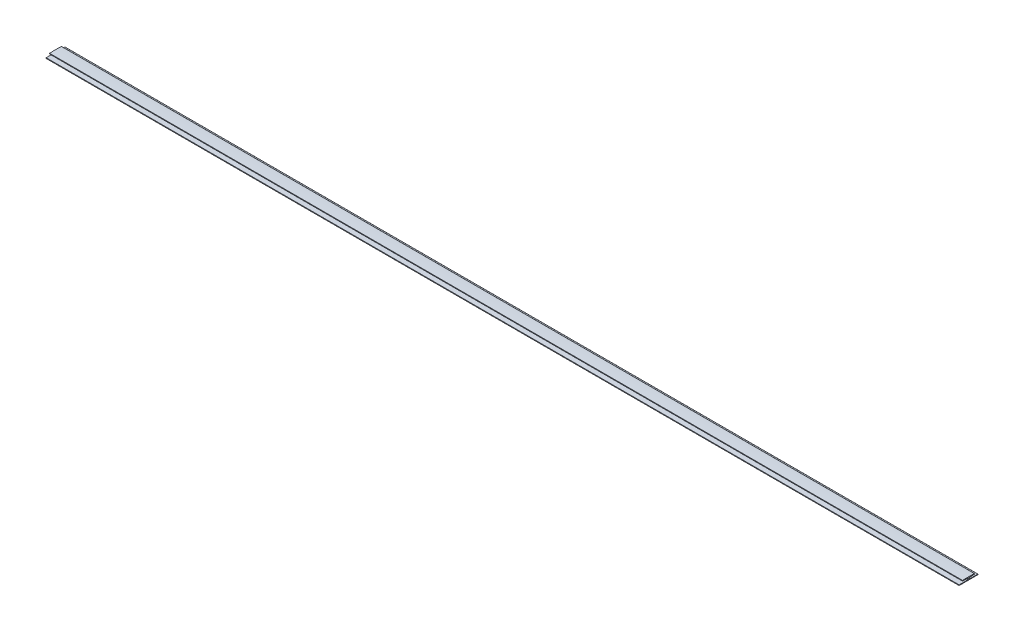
ISO-10303-21;
HEADER;
FILE_DESCRIPTION(('STEP AP214'),'2;1');
FILE_NAME('part.step','',(''),(''),'','','');
FILE_SCHEMA(('AUTOMOTIVE_DESIGN { 1 0 10303 214 1 1 1 1 }'));
ENDSEC;
DATA;
#1=APPLICATION_CONTEXT('core data for automotive mechanical design processes');
#2=APPLICATION_PROTOCOL_DEFINITION('international standard','automotive_design',2000,#1);
#3=PRODUCT_CONTEXT('',#1,'mechanical');
#4=PRODUCT('Part','Part','',(#3));
#5=PRODUCT_RELATED_PRODUCT_CATEGORY('part','',(#4));
#6=PRODUCT_DEFINITION_FORMATION('','',#4);
#7=PRODUCT_DEFINITION_CONTEXT('part definition',#1,'design');
#8=PRODUCT_DEFINITION('design','',#6,#7);
#9=PRODUCT_DEFINITION_SHAPE('','',#8);
#10=(LENGTH_UNIT() NAMED_UNIT(*) SI_UNIT(.MILLI.,.METRE.));
#11=(NAMED_UNIT(*) PLANE_ANGLE_UNIT() SI_UNIT($,.RADIAN.));
#12=(NAMED_UNIT(*) SI_UNIT($,.STERADIAN.) SOLID_ANGLE_UNIT());
#13=UNCERTAINTY_MEASURE_WITH_UNIT(LENGTH_MEASURE(1.E-05),#10,'distance_accuracy_value','');
#14=(GEOMETRIC_REPRESENTATION_CONTEXT(3) GLOBAL_UNCERTAINTY_ASSIGNED_CONTEXT((#13)) GLOBAL_UNIT_ASSIGNED_CONTEXT((#10,
#11,#12)) REPRESENTATION_CONTEXT('',''));
#15=CARTESIAN_POINT('',(0.,0.,0.));
#16=DIRECTION('',(0.,0.,1.));
#17=DIRECTION('',(1.,0.,0.));
#18=AXIS2_PLACEMENT_3D('',#15,#16,#17);
#19=CARTESIAN_POINT('',(-609.6,-0.230658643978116,12.446));
#20=DIRECTION('',(1.,0.,0.));
#21=DIRECTION('',(0.,0.,-1.));
#22=AXIS2_PLACEMENT_3D('',#19,#20,#21);
#23=CYLINDRICAL_SURFACE('',#22,0.254);
#24=DIRECTION('',(1.,0.,0.));
#25=VECTOR('',#24,1.);
#26=CARTESIAN_POINT('',(-609.6,-0.230658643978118,12.7));
#27=LINE('',#26,#25);
#28=CARTESIAN_POINT('',(-609.6,-0.230658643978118,12.7));
#29=VERTEX_POINT('',#28);
#30=CARTESIAN_POINT('',(609.6,-0.230658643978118,12.7));
#31=VERTEX_POINT('',#30);
#32=EDGE_CURVE('E37',#29,#31,#27,.T.);
#33=ORIENTED_EDGE('',*,*,#32,.T.);
#34=CARTESIAN_POINT('',(609.6,-0.230658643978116,12.446));
#35=DIRECTION('',(1.,0.,0.));
#36=DIRECTION('',(0.,0.,-1.));
#37=AXIS2_PLACEMENT_3D('',#34,#35,#36);
#38=CIRCLE('',#37,0.254);
#39=CARTESIAN_POINT('',(609.6,0.023341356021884,12.446));
#40=VERTEX_POINT('',#39);
#41=EDGE_CURVE('E170',#40,#31,#38,.T.);
#42=ORIENTED_EDGE('',*,*,#41,.F.);
#43=DIRECTION('',(1.,0.,0.));
#44=VECTOR('',#43,1.);
#45=CARTESIAN_POINT('',(-609.6,0.023341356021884,12.446));
#46=LINE('',#45,#44);
#47=CARTESIAN_POINT('',(-609.6,0.023341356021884,12.446));
#48=VERTEX_POINT('',#47);
#49=EDGE_CURVE('E11',#48,#40,#46,.T.);
#50=ORIENTED_EDGE('',*,*,#49,.F.);
#51=CARTESIAN_POINT('',(-609.6,-0.230658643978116,12.446));
#52=DIRECTION('',(1.,0.,0.));
#53=DIRECTION('',(0.,0.,-1.));
#54=AXIS2_PLACEMENT_3D('',#51,#52,#53);
#55=CIRCLE('',#54,0.254);
#56=EDGE_CURVE('E171',#48,#29,#55,.T.);
#57=ORIENTED_EDGE('',*,*,#56,.T.);
#58=EDGE_LOOP('',(#33,#42,#50,#57));
#59=FACE_BOUND('',#58,.T.);
#60=ADVANCED_FACE('F34',(#59),#23,.T.);
#61=CARTESIAN_POINT('',(-609.6,0.0233413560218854,0.396875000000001));
#62=DIRECTION('',(0.,1.,0.));
#63=DIRECTION('',(0.,0.,1.));
#64=AXIS2_PLACEMENT_3D('',#61,#62,#63);
#65=PLANE('',#64);
#66=ORIENTED_EDGE('',*,*,#49,.T.);
#67=DIRECTION('',(0.,0.,1.));
#68=VECTOR('',#67,1.);
#69=CARTESIAN_POINT('',(609.6,0.0233413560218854,0.396875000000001));
#70=LINE('',#69,#68);
#71=CARTESIAN_POINT('',(609.6,0.0233413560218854,0.396875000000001));
#72=VERTEX_POINT('',#71);
#73=EDGE_CURVE('E188',#72,#40,#70,.T.);
#74=ORIENTED_EDGE('',*,*,#73,.F.);
#75=DIRECTION('',(1.,0.,0.));
#76=VECTOR('',#75,1.);
#77=CARTESIAN_POINT('',(-609.6,0.0233413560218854,0.396875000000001));
#78=LINE('',#77,#76);
#79=CARTESIAN_POINT('',(-609.6,0.0233413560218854,0.396875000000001));
#80=VERTEX_POINT('',#79);
#81=EDGE_CURVE('E42',#80,#72,#78,.T.);
#82=ORIENTED_EDGE('',*,*,#81,.F.);
#83=DIRECTION('',(0.,0.,1.));
#84=VECTOR('',#83,1.);
#85=CARTESIAN_POINT('',(-609.6,0.0233413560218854,0.396875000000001));
#86=LINE('',#85,#84);
#87=EDGE_CURVE('E176',#80,#48,#86,.T.);
#88=ORIENTED_EDGE('',*,*,#87,.T.);
#89=EDGE_LOOP('',(#66,#74,#82,#88));
#90=FACE_BOUND('',#89,.T.);
#91=ADVANCED_FACE('F396',(#90),#65,.T.);
#92=CARTESIAN_POINT('',(-609.6,1.61084135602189,0.396875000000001));
#93=DIRECTION('',(0.,0.,1.));
#94=DIRECTION('',(0.,-1.,0.));
#95=AXIS2_PLACEMENT_3D('',#92,#93,#94);
#96=PLANE('',#95);
#97=ORIENTED_EDGE('',*,*,#81,.T.);
#98=DIRECTION('',(0.,-1.,0.));
#99=VECTOR('',#98,1.);
#100=CARTESIAN_POINT('',(609.6,1.61084135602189,0.396875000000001));
#101=LINE('',#100,#99);
#102=CARTESIAN_POINT('',(609.6,1.61084135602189,0.396875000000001));
#103=VERTEX_POINT('',#102);
#104=EDGE_CURVE('E237',#103,#72,#101,.T.);
#105=ORIENTED_EDGE('',*,*,#104,.F.);
#106=DIRECTION('',(1.,0.,0.));
#107=VECTOR('',#106,1.);
#108=CARTESIAN_POINT('',(-609.6,1.61084135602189,0.396875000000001));
#109=LINE('',#108,#107);
#110=CARTESIAN_POINT('',(-609.6,1.61084135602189,0.396875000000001));
#111=VERTEX_POINT('',#110);
#112=EDGE_CURVE('E295',#111,#103,#109,.T.);
#113=ORIENTED_EDGE('',*,*,#112,.F.);
#114=DIRECTION('',(0.,-1.,0.));
#115=VECTOR('',#114,1.);
#116=CARTESIAN_POINT('',(-609.6,1.61084135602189,0.396875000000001));
#117=LINE('',#116,#115);
#118=EDGE_CURVE('E291',#111,#80,#117,.T.);
#119=ORIENTED_EDGE('',*,*,#118,.T.);
#120=EDGE_LOOP('',(#97,#105,#113,#119));
#121=FACE_BOUND('',#120,.T.);
#122=ADVANCED_FACE('F395',(#121),#96,.T.);
#123=CARTESIAN_POINT('',(-609.6,2.08215074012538,7.90825231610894));
#124=DIRECTION('',(0.,-0.998037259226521,0.0626229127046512));
#125=DIRECTION('',(0.,-0.0626229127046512,-0.998037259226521));
#126=AXIS2_PLACEMENT_3D('',#123,#124,#125);
#127=PLANE('',#126);
#128=ORIENTED_EDGE('',*,*,#112,.T.);
#129=DIRECTION('',(0.,-0.0626229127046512,-0.998037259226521));
#130=VECTOR('',#129,1.);
#131=CARTESIAN_POINT('',(609.6,2.08215074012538,7.90825231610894));
#132=LINE('',#131,#130);
#133=CARTESIAN_POINT('',(609.6,2.08215074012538,7.90825231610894));
#134=VERTEX_POINT('',#133);
#135=EDGE_CURVE('E234',#134,#103,#132,.T.);
#136=ORIENTED_EDGE('',*,*,#135,.F.);
#137=DIRECTION('',(1.,0.,0.));
#138=VECTOR('',#137,1.);
#139=CARTESIAN_POINT('',(-609.6,2.08215074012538,7.90825231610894));
#140=LINE('',#139,#138);
#141=CARTESIAN_POINT('',(-609.6,2.08215074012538,7.90825231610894));
#142=VERTEX_POINT('',#141);
#143=EDGE_CURVE('E297',#142,#134,#140,.T.);
#144=ORIENTED_EDGE('',*,*,#143,.F.);
#145=DIRECTION('',(0.,-0.0626229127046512,-0.998037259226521));
#146=VECTOR('',#145,1.);
#147=CARTESIAN_POINT('',(-609.6,2.08215074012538,7.90825231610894));
#148=LINE('',#147,#146);
#149=EDGE_CURVE('E288',#142,#111,#148,.T.);
#150=ORIENTED_EDGE('',*,*,#149,.T.);
#151=EDGE_LOOP('',(#128,#136,#144,#150));
#152=FACE_BOUND('',#151,.T.);
#153=ADVANCED_FACE('F391',(#152),#127,.T.);
#154=CARTESIAN_POINT('',(-609.6,2.3356522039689,7.89234609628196));
#155=DIRECTION('',(1.,0.,0.));
#156=DIRECTION('',(0.,0.,-1.));
#157=AXIS2_PLACEMENT_3D('',#154,#155,#156);
#158=CYLINDRICAL_SURFACE('',#157,0.253999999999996);
#159=ORIENTED_EDGE('',*,*,#143,.T.);
#160=CARTESIAN_POINT('',(609.6,2.3356522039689,7.89234609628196));
#161=DIRECTION('',(1.,0.,0.));
#162=DIRECTION('',(0.,0.,-1.));
#163=AXIS2_PLACEMENT_3D('',#160,#161,#162);
#164=CIRCLE('',#163,0.253999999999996);
#165=CARTESIAN_POINT('',(609.6,2.35155842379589,8.14584756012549));
#166=VERTEX_POINT('',#165);
#167=EDGE_CURVE('E231',#166,#134,#164,.T.);
#168=ORIENTED_EDGE('',*,*,#167,.F.);
#169=DIRECTION('',(1.,0.,0.));
#170=VECTOR('',#169,1.);
#171=CARTESIAN_POINT('',(-609.6,2.35155842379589,8.14584756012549));
#172=LINE('',#171,#170);
#173=CARTESIAN_POINT('',(-609.6,2.35155842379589,8.14584756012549));
#174=VERTEX_POINT('',#173);
#175=EDGE_CURVE('E299',#174,#166,#172,.T.);
#176=ORIENTED_EDGE('',*,*,#175,.F.);
#177=CARTESIAN_POINT('',(-609.6,2.3356522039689,7.89234609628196));
#178=DIRECTION('',(1.,0.,0.));
#179=DIRECTION('',(0.,0.,-1.));
#180=AXIS2_PLACEMENT_3D('',#177,#178,#179);
#181=CIRCLE('',#180,0.253999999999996);
#182=EDGE_CURVE('E285',#174,#142,#181,.T.);
#183=ORIENTED_EDGE('',*,*,#182,.T.);
#184=EDGE_LOOP('',(#159,#168,#176,#183));
#185=FACE_BOUND('',#184,.T.);
#186=ADVANCED_FACE('F386',(#185),#158,.T.);
#187=CARTESIAN_POINT('',(-609.6,2.63674757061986,8.12795306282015));
#188=DIRECTION('',(0.,0.0626229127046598,0.99803725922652));
#189=DIRECTION('',(0.,-0.99803725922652,0.0626229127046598));
#190=AXIS2_PLACEMENT_3D('',#187,#188,#189);
#191=PLANE('',#190);
#192=ORIENTED_EDGE('',*,*,#175,.T.);
#193=DIRECTION('',(0.,-0.99803725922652,0.0626229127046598));
#194=VECTOR('',#193,1.);
#195=CARTESIAN_POINT('',(609.6,2.63674757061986,8.12795306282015));
#196=LINE('',#195,#194);
#197=CARTESIAN_POINT('',(609.6,2.63674757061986,8.12795306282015));
#198=VERTEX_POINT('',#197);
#199=EDGE_CURVE('E228',#198,#166,#196,.T.);
#200=ORIENTED_EDGE('',*,*,#199,.F.);
#201=DIRECTION('',(1.,0.,0.));
#202=VECTOR('',#201,1.);
#203=CARTESIAN_POINT('',(-609.6,2.63674757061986,8.12795306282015));
#204=LINE('',#203,#202);
#205=CARTESIAN_POINT('',(-609.6,2.63674757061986,8.12795306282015));
#206=VERTEX_POINT('',#205);
#207=EDGE_CURVE('E301',#206,#198,#204,.T.);
#208=ORIENTED_EDGE('',*,*,#207,.F.);
#209=DIRECTION('',(0.,-0.99803725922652,0.0626229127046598));
#210=VECTOR('',#209,1.);
#211=CARTESIAN_POINT('',(-609.6,2.63674757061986,8.12795306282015));
#212=LINE('',#211,#210);
#213=EDGE_CURVE('E282',#206,#174,#212,.T.);
#214=ORIENTED_EDGE('',*,*,#213,.T.);
#215=EDGE_LOOP('',(#192,#200,#208,#214));
#216=FACE_BOUND('',#215,.T.);
#217=ADVANCED_FACE('F384',(#216),#191,.T.);
#218=CARTESIAN_POINT('',(-609.6,2.62084135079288,7.87445159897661));
#219=DIRECTION('',(1.,0.,0.));
#220=DIRECTION('',(0.,0.,-1.));
#221=AXIS2_PLACEMENT_3D('',#218,#219,#220);
#222=CYLINDRICAL_SURFACE('',#221,0.254000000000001);
#223=ORIENTED_EDGE('',*,*,#207,.T.);
#224=CARTESIAN_POINT('',(609.6,2.62084135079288,7.87445159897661));
#225=DIRECTION('',(1.,0.,0.));
#226=DIRECTION('',(0.,0.,-1.));
#227=AXIS2_PLACEMENT_3D('',#224,#225,#226);
#228=CIRCLE('',#227,0.254000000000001);
#229=CARTESIAN_POINT('',(609.6,2.87434281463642,7.85854537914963));
#230=VERTEX_POINT('',#229);
#231=EDGE_CURVE('E225',#230,#198,#228,.T.);
#232=ORIENTED_EDGE('',*,*,#231,.F.);
#233=DIRECTION('',(1.,0.,0.));
#234=VECTOR('',#233,1.);
#235=CARTESIAN_POINT('',(-609.6,2.87434281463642,7.85854537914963));
#236=LINE('',#235,#234);
#237=CARTESIAN_POINT('',(-609.6,2.87434281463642,7.85854537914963));
#238=VERTEX_POINT('',#237);
#239=EDGE_CURVE('E303',#238,#230,#236,.T.);
#240=ORIENTED_EDGE('',*,*,#239,.F.);
#241=CARTESIAN_POINT('',(-609.6,2.62084135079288,7.87445159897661));
#242=DIRECTION('',(1.,0.,0.));
#243=DIRECTION('',(0.,0.,-1.));
#244=AXIS2_PLACEMENT_3D('',#241,#242,#243);
#245=CIRCLE('',#244,0.254000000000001);
#246=EDGE_CURVE('E279',#238,#206,#245,.T.);
#247=ORIENTED_EDGE('',*,*,#246,.T.);
#248=EDGE_LOOP('',(#223,#232,#240,#247));
#249=FACE_BOUND('',#248,.T.);
#250=ADVANCED_FACE('F379',(#249),#222,.T.);
#251=CARTESIAN_POINT('',(-609.6,-149.322908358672,1.1910830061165E-08));
#252=DIRECTION('',(1.,0.,0.));
#253=DIRECTION('',(0.,0.,-1.));
#254=AXIS2_PLACEMENT_3D('',#251,#252,#253);
#255=CYLINDRICAL_SURFACE('',#254,152.4);
#256=ORIENTED_EDGE('',*,*,#239,.T.);
#257=CARTESIAN_POINT('',(609.6,-149.322908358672,1.1910830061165E-08));
#258=DIRECTION('',(1.,0.,0.));
#259=DIRECTION('',(0.,0.,1.));
#260=AXIS2_PLACEMENT_3D('',#257,#258,#259);
#261=CIRCLE('',#260,152.4);
#262=CARTESIAN_POINT('',(609.6,2.87434281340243,-7.85854537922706));
#263=VERTEX_POINT('',#262);
#264=EDGE_CURVE('E222',#263,#230,#261,.T.);
#265=ORIENTED_EDGE('',*,*,#264,.F.);
#266=DIRECTION('',(1.,0.,0.));
#267=VECTOR('',#266,1.);
#268=CARTESIAN_POINT('',(-609.6,2.87434281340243,-7.85854537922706));
#269=LINE('',#268,#267);
#270=CARTESIAN_POINT('',(-609.6,2.87434281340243,-7.85854537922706));
#271=VERTEX_POINT('',#270);
#272=EDGE_CURVE('E305',#271,#263,#269,.T.);
#273=ORIENTED_EDGE('',*,*,#272,.F.);
#274=CARTESIAN_POINT('',(-609.6,-149.322908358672,1.1910830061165E-08));
#275=DIRECTION('',(1.,0.,0.));
#276=DIRECTION('',(0.,0.,1.));
#277=AXIS2_PLACEMENT_3D('',#274,#275,#276);
#278=CIRCLE('',#277,152.4);
#279=EDGE_CURVE('E276',#271,#238,#278,.T.);
#280=ORIENTED_EDGE('',*,*,#279,.T.);
#281=EDGE_LOOP('',(#256,#265,#273,#280));
#282=FACE_BOUND('',#281,.T.);
#283=ADVANCED_FACE('F374',(#282),#255,.T.);
#284=CARTESIAN_POINT('',(-609.6,2.62084134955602,-7.87445159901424));
#285=DIRECTION('',(1.,0.,0.));
#286=DIRECTION('',(0.,0.,-1.));
#287=AXIS2_PLACEMENT_3D('',#284,#285,#286);
#288=CYLINDRICAL_SURFACE('',#287,0.254000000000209);
#289=ORIENTED_EDGE('',*,*,#272,.T.);
#290=CARTESIAN_POINT('',(609.6,2.62084134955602,-7.87445159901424));
#291=DIRECTION('',(1.,0.,0.));
#292=DIRECTION('',(0.,0.,1.));
#293=AXIS2_PLACEMENT_3D('',#290,#291,#292);
#294=CIRCLE('',#293,0.254000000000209);
#295=CARTESIAN_POINT('',(609.6,2.63674756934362,-8.12795306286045));
#296=VERTEX_POINT('',#295);
#297=EDGE_CURVE('E219',#296,#263,#294,.T.);
#298=ORIENTED_EDGE('',*,*,#297,.F.);
#299=DIRECTION('',(1.,0.,0.));
#300=VECTOR('',#299,1.);
#301=CARTESIAN_POINT('',(-609.6,2.63674756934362,-8.12795306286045));
#302=LINE('',#301,#300);
#303=CARTESIAN_POINT('',(-609.6,2.63674756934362,-8.12795306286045));
#304=VERTEX_POINT('',#303);
#305=EDGE_CURVE('E307',#304,#296,#302,.T.);
#306=ORIENTED_EDGE('',*,*,#305,.F.);
#307=CARTESIAN_POINT('',(-609.6,2.62084134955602,-7.87445159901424));
#308=DIRECTION('',(1.,0.,0.));
#309=DIRECTION('',(0.,0.,1.));
#310=AXIS2_PLACEMENT_3D('',#307,#308,#309);
#311=CIRCLE('',#310,0.254000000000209);
#312=EDGE_CURVE('E273',#304,#271,#311,.T.);
#313=ORIENTED_EDGE('',*,*,#312,.T.);
#314=EDGE_LOOP('',(#289,#298,#306,#313));
#315=FACE_BOUND('',#314,.T.);
#316=ADVANCED_FACE('F372',(#315),#288,.T.);
#317=CARTESIAN_POINT('',(-609.6,2.63674756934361,-8.12795306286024));
#318=DIRECTION('',(0.,0.0626229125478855,-0.998037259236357));
#319=DIRECTION('',(0.,0.998037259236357,0.0626229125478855));
#320=AXIS2_PLACEMENT_3D('',#317,#318,#319);
#321=PLANE('',#320);
#322=ORIENTED_EDGE('',*,*,#305,.T.);
#323=DIRECTION('',(0.,0.998037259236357,0.0626229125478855));
#324=VECTOR('',#323,1.);
#325=CARTESIAN_POINT('',(609.6,2.63674756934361,-8.12795306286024));
#326=LINE('',#325,#324);
#327=CARTESIAN_POINT('',(609.6,2.3515584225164,-8.14584756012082));
#328=VERTEX_POINT('',#327);
#329=EDGE_CURVE('E216',#328,#296,#326,.T.);
#330=ORIENTED_EDGE('',*,*,#329,.F.);
#331=DIRECTION('',(1.,0.,0.));
#332=VECTOR('',#331,1.);
#333=CARTESIAN_POINT('',(-609.6,2.3515584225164,-8.14584756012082));
#334=LINE('',#333,#332);
#335=CARTESIAN_POINT('',(-609.6,2.3515584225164,-8.14584756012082));
#336=VERTEX_POINT('',#335);
#337=EDGE_CURVE('E309',#336,#328,#334,.T.);
#338=ORIENTED_EDGE('',*,*,#337,.F.);
#339=DIRECTION('',(0.,0.998037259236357,0.0626229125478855));
#340=VECTOR('',#339,1.);
#341=CARTESIAN_POINT('',(-609.6,2.63674756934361,-8.12795306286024));
#342=LINE('',#341,#340);
#343=EDGE_CURVE('E270',#336,#304,#342,.T.);
#344=ORIENTED_EDGE('',*,*,#343,.T.);
#345=EDGE_LOOP('',(#322,#330,#338,#344));
#346=FACE_BOUND('',#345,.T.);
#347=ADVANCED_FACE('F367',(#346),#321,.T.);
#348=CARTESIAN_POINT('',(-609.6,2.33565220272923,-7.8923460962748));
#349=DIRECTION('',(1.,0.,0.));
#350=DIRECTION('',(0.,0.,-1.));
#351=AXIS2_PLACEMENT_3D('',#348,#349,#350);
#352=CYLINDRICAL_SURFACE('',#351,0.253999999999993);
#353=ORIENTED_EDGE('',*,*,#337,.T.);
#354=CARTESIAN_POINT('',(609.6,2.33565220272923,-7.8923460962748));
#355=DIRECTION('',(1.,0.,0.));
#356=DIRECTION('',(0.,0.,1.));
#357=AXIS2_PLACEMENT_3D('',#354,#355,#356);
#358=CIRCLE('',#357,0.253999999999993);
#359=CARTESIAN_POINT('',(609.6,2.08215073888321,-7.90825231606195));
#360=VERTEX_POINT('',#359);
#361=EDGE_CURVE('E213',#360,#328,#358,.T.);
#362=ORIENTED_EDGE('',*,*,#361,.F.);
#363=DIRECTION('',(1.,0.,0.));
#364=VECTOR('',#363,1.);
#365=CARTESIAN_POINT('',(-609.6,2.08215073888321,-7.90825231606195));
#366=LINE('',#365,#364);
#367=CARTESIAN_POINT('',(-609.6,2.08215073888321,-7.90825231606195));
#368=VERTEX_POINT('',#367);
#369=EDGE_CURVE('E311',#368,#360,#366,.T.);
#370=ORIENTED_EDGE('',*,*,#369,.F.);
#371=CARTESIAN_POINT('',(-609.6,2.33565220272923,-7.8923460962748));
#372=DIRECTION('',(1.,0.,0.));
#373=DIRECTION('',(0.,0.,1.));
#374=AXIS2_PLACEMENT_3D('',#371,#372,#373);
#375=CIRCLE('',#374,0.253999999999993);
#376=EDGE_CURVE('E267',#368,#336,#375,.T.);
#377=ORIENTED_EDGE('',*,*,#376,.T.);
#378=EDGE_LOOP('',(#353,#362,#370,#377));
#379=FACE_BOUND('',#378,.T.);
#380=ADVANCED_FACE('F362',(#379),#352,.T.);
#381=CARTESIAN_POINT('',(-609.6,2.08215073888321,-7.90825231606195));
#382=DIRECTION('',(0.,-0.998037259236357,-0.0626229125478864));
#383=DIRECTION('',(0.,0.0626229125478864,-0.998037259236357));
#384=AXIS2_PLACEMENT_3D('',#381,#382,#383);
#385=PLANE('',#384);
#386=ORIENTED_EDGE('',*,*,#369,.T.);
#387=DIRECTION('',(0.,0.0626229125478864,-0.998037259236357));
#388=VECTOR('',#387,1.);
#389=CARTESIAN_POINT('',(609.6,2.08215073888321,-7.90825231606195));
#390=LINE('',#389,#388);
#391=CARTESIAN_POINT('',(609.6,1.61084135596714,-0.396874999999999));
#392=VERTEX_POINT('',#391);
#393=EDGE_CURVE('E210',#392,#360,#390,.T.);
#394=ORIENTED_EDGE('',*,*,#393,.F.);
#395=DIRECTION('',(1.,0.,0.));
#396=VECTOR('',#395,1.);
#397=CARTESIAN_POINT('',(-609.6,1.61084135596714,-0.396874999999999));
#398=LINE('',#397,#396);
#399=CARTESIAN_POINT('',(-609.6,1.61084135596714,-0.396874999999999));
#400=VERTEX_POINT('',#399);
#401=EDGE_CURVE('E313',#400,#392,#398,.T.);
#402=ORIENTED_EDGE('',*,*,#401,.F.);
#403=DIRECTION('',(0.,0.0626229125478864,-0.998037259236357));
#404=VECTOR('',#403,1.);
#405=CARTESIAN_POINT('',(-609.6,2.08215073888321,-7.90825231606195));
#406=LINE('',#405,#404);
#407=EDGE_CURVE('E264',#400,#368,#406,.T.);
#408=ORIENTED_EDGE('',*,*,#407,.T.);
#409=EDGE_LOOP('',(#386,#394,#402,#408));
#410=FACE_BOUND('',#409,.T.);
#411=ADVANCED_FACE('F360',(#410),#385,.T.);
#412=CARTESIAN_POINT('',(-609.6,1.61084135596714,-0.396874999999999));
#413=DIRECTION('',(0.,0.,-1.));
#414=DIRECTION('',(-1.,0.,0.));
#415=AXIS2_PLACEMENT_3D('',#412,#413,#414);
#416=PLANE('',#415);
#417=ORIENTED_EDGE('',*,*,#401,.T.);
#418=DIRECTION('',(0.,1.,0.));
#419=VECTOR('',#418,1.);
#420=CARTESIAN_POINT('',(609.6,1.61084135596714,-0.396874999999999));
#421=LINE('',#420,#419);
#422=CARTESIAN_POINT('',(609.6,0.,-0.396874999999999));
#423=VERTEX_POINT('',#422);
#424=EDGE_CURVE('E207',#423,#392,#421,.T.);
#425=ORIENTED_EDGE('',*,*,#424,.F.);
#426=DIRECTION('',(1.,0.,0.));
#427=VECTOR('',#426,1.);
#428=CARTESIAN_POINT('',(-609.6,0.,-0.396874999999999));
#429=LINE('',#428,#427);
#430=CARTESIAN_POINT('',(-609.6,0.,-0.396874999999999));
#431=VERTEX_POINT('',#430);
#432=EDGE_CURVE('E315',#431,#423,#429,.T.);
#433=ORIENTED_EDGE('',*,*,#432,.F.);
#434=DIRECTION('',(0.,1.,0.));
#435=VECTOR('',#434,1.);
#436=CARTESIAN_POINT('',(-609.6,1.61084135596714,-0.396874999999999));
#437=LINE('',#436,#435);
#438=EDGE_CURVE('E261',#431,#400,#437,.T.);
#439=ORIENTED_EDGE('',*,*,#438,.T.);
#440=EDGE_LOOP('',(#417,#425,#433,#439));
#441=FACE_BOUND('',#440,.T.);
#442=ADVANCED_FACE('F355',(#441),#416,.T.);
#443=CARTESIAN_POINT('',(-609.6,0.,-12.446));
#444=DIRECTION('',(0.,1.,0.));
#445=DIRECTION('',(0.,0.,1.));
#446=AXIS2_PLACEMENT_3D('',#443,#444,#445);
#447=PLANE('',#446);
#448=ORIENTED_EDGE('',*,*,#432,.T.);
#449=DIRECTION('',(0.,0.,1.));
#450=VECTOR('',#449,1.);
#451=CARTESIAN_POINT('',(609.6,0.,-12.446));
#452=LINE('',#451,#450);
#453=CARTESIAN_POINT('',(609.6,0.,-12.446));
#454=VERTEX_POINT('',#453);
#455=EDGE_CURVE('E204',#454,#423,#452,.T.);
#456=ORIENTED_EDGE('',*,*,#455,.F.);
#457=DIRECTION('',(1.,0.,0.));
#458=VECTOR('',#457,1.);
#459=CARTESIAN_POINT('',(-609.6,0.,-12.446));
#460=LINE('',#459,#458);
#461=CARTESIAN_POINT('',(-609.6,0.,-12.446));
#462=VERTEX_POINT('',#461);
#463=EDGE_CURVE('E317',#462,#454,#460,.T.);
#464=ORIENTED_EDGE('',*,*,#463,.F.);
#465=DIRECTION('',(0.,0.,1.));
#466=VECTOR('',#465,1.);
#467=CARTESIAN_POINT('',(-609.6,0.,-12.446));
#468=LINE('',#467,#466);
#469=EDGE_CURVE('E258',#462,#431,#468,.T.);
#470=ORIENTED_EDGE('',*,*,#469,.T.);
#471=EDGE_LOOP('',(#448,#456,#464,#470));
#472=FACE_BOUND('',#471,.T.);
#473=ADVANCED_FACE('F350',(#472),#447,.T.);
#474=CARTESIAN_POINT('',(-609.6,-0.254,-12.446));
#475=DIRECTION('',(1.,0.,0.));
#476=DIRECTION('',(0.,0.,-1.));
#477=AXIS2_PLACEMENT_3D('',#474,#475,#476);
#478=CYLINDRICAL_SURFACE('',#477,0.254);
#479=ORIENTED_EDGE('',*,*,#463,.T.);
#480=CARTESIAN_POINT('',(609.6,-0.254,-12.446));
#481=DIRECTION('',(1.,0.,0.));
#482=DIRECTION('',(0.,0.,-1.));
#483=AXIS2_PLACEMENT_3D('',#480,#481,#482);
#484=CIRCLE('',#483,0.254);
#485=CARTESIAN_POINT('',(609.6,-0.254000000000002,-12.7));
#486=VERTEX_POINT('',#485);
#487=EDGE_CURVE('E201',#486,#454,#484,.T.);
#488=ORIENTED_EDGE('',*,*,#487,.F.);
#489=DIRECTION('',(1.,0.,0.));
#490=VECTOR('',#489,1.);
#491=CARTESIAN_POINT('',(-609.6,-0.254000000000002,-12.7));
#492=LINE('',#491,#490);
#493=CARTESIAN_POINT('',(-609.6,-0.254000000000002,-12.7));
#494=VERTEX_POINT('',#493);
#495=EDGE_CURVE('E319',#494,#486,#492,.T.);
#496=ORIENTED_EDGE('',*,*,#495,.F.);
#497=CARTESIAN_POINT('',(-609.6,-0.254,-12.446));
#498=DIRECTION('',(1.,0.,0.));
#499=DIRECTION('',(0.,0.,-1.));
#500=AXIS2_PLACEMENT_3D('',#497,#498,#499);
#501=CIRCLE('',#500,0.254);
#502=EDGE_CURVE('E255',#494,#462,#501,.T.);
#503=ORIENTED_EDGE('',*,*,#502,.T.);
#504=EDGE_LOOP('',(#479,#488,#496,#503));
#505=FACE_BOUND('',#504,.T.);
#506=ADVANCED_FACE('F348',(#505),#478,.T.);
#507=CARTESIAN_POINT('',(-609.6,-0.539749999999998,-12.7));
#508=DIRECTION('',(0.,0.,-1.));
#509=DIRECTION('',(-1.,0.,0.));
#510=AXIS2_PLACEMENT_3D('',#507,#508,#509);
#511=PLANE('',#510);
#512=ORIENTED_EDGE('',*,*,#495,.T.);
#513=DIRECTION('',(0.,1.,0.));
#514=VECTOR('',#513,1.);
#515=CARTESIAN_POINT('',(609.6,-0.539749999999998,-12.7));
#516=LINE('',#515,#514);
#517=CARTESIAN_POINT('',(609.6,-0.539749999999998,-12.7));
#518=VERTEX_POINT('',#517);
#519=EDGE_CURVE('E198',#518,#486,#516,.T.);
#520=ORIENTED_EDGE('',*,*,#519,.F.);
#521=DIRECTION('',(1.,0.,0.));
#522=VECTOR('',#521,1.);
#523=CARTESIAN_POINT('',(-609.6,-0.539749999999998,-12.7));
#524=LINE('',#523,#522);
#525=CARTESIAN_POINT('',(-609.6,-0.539749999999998,-12.7));
#526=VERTEX_POINT('',#525);
#527=EDGE_CURVE('E321',#526,#518,#524,.T.);
#528=ORIENTED_EDGE('',*,*,#527,.F.);
#529=DIRECTION('',(0.,1.,0.));
#530=VECTOR('',#529,1.);
#531=CARTESIAN_POINT('',(-609.6,-0.539749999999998,-12.7));
#532=LINE('',#531,#530);
#533=EDGE_CURVE('E252',#526,#494,#532,.T.);
#534=ORIENTED_EDGE('',*,*,#533,.T.);
#535=EDGE_LOOP('',(#512,#520,#528,#534));
#536=FACE_BOUND('',#535,.T.);
#537=ADVANCED_FACE('F343',(#536),#511,.T.);
#538=CARTESIAN_POINT('',(-609.6,-0.53975,-12.446));
#539=DIRECTION('',(1.,0.,0.));
#540=DIRECTION('',(0.,0.,-1.));
#541=AXIS2_PLACEMENT_3D('',#538,#539,#540);
#542=CYLINDRICAL_SURFACE('',#541,0.254);
#543=ORIENTED_EDGE('',*,*,#527,.T.);
#544=CARTESIAN_POINT('',(609.6,-0.53975,-12.446));
#545=DIRECTION('',(1.,0.,0.));
#546=DIRECTION('',(0.,0.,-1.));
#547=AXIS2_PLACEMENT_3D('',#544,#545,#546);
#548=CIRCLE('',#547,0.254);
#549=CARTESIAN_POINT('',(609.6,-0.79375,-12.446));
#550=VERTEX_POINT('',#549);
#551=EDGE_CURVE('E195',#550,#518,#548,.T.);
#552=ORIENTED_EDGE('',*,*,#551,.F.);
#553=DIRECTION('',(1.,0.,0.));
#554=VECTOR('',#553,1.);
#555=CARTESIAN_POINT('',(-609.6,-0.79375,-12.446));
#556=LINE('',#555,#554);
#557=CARTESIAN_POINT('',(-609.6,-0.79375,-12.446));
#558=VERTEX_POINT('',#557);
#559=EDGE_CURVE('E323',#558,#550,#556,.T.);
#560=ORIENTED_EDGE('',*,*,#559,.F.);
#561=CARTESIAN_POINT('',(-609.6,-0.53975,-12.446));
#562=DIRECTION('',(1.,0.,0.));
#563=DIRECTION('',(0.,0.,-1.));
#564=AXIS2_PLACEMENT_3D('',#561,#562,#563);
#565=CIRCLE('',#564,0.254);
#566=EDGE_CURVE('E249',#558,#526,#565,.T.);
#567=ORIENTED_EDGE('',*,*,#566,.T.);
#568=EDGE_LOOP('',(#543,#552,#560,#567));
#569=FACE_BOUND('',#568,.T.);
#570=ADVANCED_FACE('F336',(#569),#542,.T.);
#571=CARTESIAN_POINT('',(-609.6,-0.79375,12.446));
#572=DIRECTION('',(0.,-1.,0.));
#573=DIRECTION('',(0.,0.,-1.));
#574=AXIS2_PLACEMENT_3D('',#571,#572,#573);
#575=PLANE('',#574);
#576=ORIENTED_EDGE('',*,*,#559,.T.);
#577=DIRECTION('',(0.,0.,-1.));
#578=VECTOR('',#577,1.);
#579=CARTESIAN_POINT('',(609.6,-0.79375,12.446));
#580=LINE('',#579,#578);
#581=CARTESIAN_POINT('',(609.6,-0.79375,12.446));
#582=VERTEX_POINT('',#581);
#583=EDGE_CURVE('E192',#582,#550,#580,.T.);
#584=ORIENTED_EDGE('',*,*,#583,.F.);
#585=DIRECTION('',(1.,0.,0.));
#586=VECTOR('',#585,1.);
#587=CARTESIAN_POINT('',(-609.6,-0.79375,12.446));
#588=LINE('',#587,#586);
#589=CARTESIAN_POINT('',(-609.6,-0.79375,12.446));
#590=VERTEX_POINT('',#589);
#591=EDGE_CURVE('E325',#590,#582,#588,.T.);
#592=ORIENTED_EDGE('',*,*,#591,.F.);
#593=DIRECTION('',(0.,0.,-1.));
#594=VECTOR('',#593,1.);
#595=CARTESIAN_POINT('',(-609.6,-0.79375,12.446));
#596=LINE('',#595,#594);
#597=EDGE_CURVE('E246',#590,#558,#596,.T.);
#598=ORIENTED_EDGE('',*,*,#597,.T.);
#599=EDGE_LOOP('',(#576,#584,#592,#598));
#600=FACE_BOUND('',#599,.T.);
#601=ADVANCED_FACE('F333',(#600),#575,.T.);
#602=CARTESIAN_POINT('',(-609.6,-0.53975,12.446));
#603=DIRECTION('',(1.,0.,0.));
#604=DIRECTION('',(0.,0.,-1.));
#605=AXIS2_PLACEMENT_3D('',#602,#603,#604);
#606=CYLINDRICAL_SURFACE('',#605,0.254);
#607=ORIENTED_EDGE('',*,*,#591,.T.);
#608=CARTESIAN_POINT('',(609.6,-0.53975,12.446));
#609=DIRECTION('',(1.,0.,0.));
#610=DIRECTION('',(0.,0.,-1.));
#611=AXIS2_PLACEMENT_3D('',#608,#609,#610);
#612=CIRCLE('',#611,0.254);
#613=CARTESIAN_POINT('',(609.6,-0.539749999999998,12.7));
#614=VERTEX_POINT('',#613);
#615=EDGE_CURVE('E183',#614,#582,#612,.T.);
#616=ORIENTED_EDGE('',*,*,#615,.F.);
#617=DIRECTION('',(1.,0.,0.));
#618=VECTOR('',#617,1.);
#619=CARTESIAN_POINT('',(-609.6,-0.539749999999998,12.7));
#620=LINE('',#619,#618);
#621=CARTESIAN_POINT('',(-609.6,-0.539749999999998,12.7));
#622=VERTEX_POINT('',#621);
#623=EDGE_CURVE('E175',#622,#614,#620,.T.);
#624=ORIENTED_EDGE('',*,*,#623,.F.);
#625=CARTESIAN_POINT('',(-609.6,-0.53975,12.446));
#626=DIRECTION('',(1.,0.,0.));
#627=DIRECTION('',(0.,0.,-1.));
#628=AXIS2_PLACEMENT_3D('',#625,#626,#627);
#629=CIRCLE('',#628,0.254);
#630=EDGE_CURVE('E243',#622,#590,#629,.T.);
#631=ORIENTED_EDGE('',*,*,#630,.T.);
#632=EDGE_LOOP('',(#607,#616,#624,#631));
#633=FACE_BOUND('',#632,.T.);
#634=ADVANCED_FACE('F327',(#633),#606,.T.);
#635=CARTESIAN_POINT('',(-609.6,-0.230658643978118,12.7));
#636=DIRECTION('',(0.,0.,1.));
#637=DIRECTION('',(1.,0.,0.));
#638=AXIS2_PLACEMENT_3D('',#635,#636,#637);
#639=PLANE('',#638);
#640=ORIENTED_EDGE('',*,*,#623,.T.);
#641=DIRECTION('',(0.,-1.,0.));
#642=VECTOR('',#641,1.);
#643=CARTESIAN_POINT('',(609.6,-0.230658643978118,12.7));
#644=LINE('',#643,#642);
#645=EDGE_CURVE('E178',#31,#614,#644,.T.);
#646=ORIENTED_EDGE('',*,*,#645,.F.);
#647=ORIENTED_EDGE('',*,*,#32,.F.);
#648=DIRECTION('',(0.,-1.,0.));
#649=VECTOR('',#648,1.);
#650=CARTESIAN_POINT('',(-609.6,-0.230658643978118,12.7));
#651=LINE('',#650,#649);
#652=EDGE_CURVE('E241',#29,#622,#651,.T.);
#653=ORIENTED_EDGE('',*,*,#652,.T.);
#654=EDGE_LOOP('',(#640,#646,#647,#653));
#655=FACE_BOUND('',#654,.T.);
#656=ADVANCED_FACE('F179',(#655),#639,.T.);
#657=CARTESIAN_POINT('',(-609.6,-0.230658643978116,12.446));
#658=DIRECTION('',(1.,0.,0.));
#659=DIRECTION('',(0.,0.,-1.));
#660=AXIS2_PLACEMENT_3D('',#657,#658,#659);
#661=PLANE('',#660);
#662=ORIENTED_EDGE('',*,*,#56,.F.);
#663=ORIENTED_EDGE('',*,*,#87,.F.);
#664=ORIENTED_EDGE('',*,*,#118,.F.);
#665=ORIENTED_EDGE('',*,*,#149,.F.);
#666=ORIENTED_EDGE('',*,*,#182,.F.);
#667=ORIENTED_EDGE('',*,*,#213,.F.);
#668=ORIENTED_EDGE('',*,*,#246,.F.);
#669=ORIENTED_EDGE('',*,*,#279,.F.);
#670=ORIENTED_EDGE('',*,*,#312,.F.);
#671=ORIENTED_EDGE('',*,*,#343,.F.);
#672=ORIENTED_EDGE('',*,*,#376,.F.);
#673=ORIENTED_EDGE('',*,*,#407,.F.);
#674=ORIENTED_EDGE('',*,*,#438,.F.);
#675=ORIENTED_EDGE('',*,*,#469,.F.);
#676=ORIENTED_EDGE('',*,*,#502,.F.);
#677=ORIENTED_EDGE('',*,*,#533,.F.);
#678=ORIENTED_EDGE('',*,*,#566,.F.);
#679=ORIENTED_EDGE('',*,*,#597,.F.);
#680=ORIENTED_EDGE('',*,*,#630,.F.);
#681=ORIENTED_EDGE('',*,*,#652,.F.);
#682=EDGE_LOOP('',(#662,#663,#664,#665,#666,#667,#668,#669,#670,#671,#672,#673,#674,#675,#676,
#677,#678,#679,#680,#681));
#683=FACE_BOUND('',#682,.T.);
#684=ADVANCED_FACE('F339',(#683),#661,.F.);
#685=CARTESIAN_POINT('',(609.6,-0.230658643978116,12.446));
#686=DIRECTION('',(1.,0.,0.));
#687=DIRECTION('',(0.,0.,-1.));
#688=AXIS2_PLACEMENT_3D('',#685,#686,#687);
#689=PLANE('',#688);
#690=ORIENTED_EDGE('',*,*,#41,.T.);
#691=ORIENTED_EDGE('',*,*,#645,.T.);
#692=ORIENTED_EDGE('',*,*,#615,.T.);
#693=ORIENTED_EDGE('',*,*,#583,.T.);
#694=ORIENTED_EDGE('',*,*,#551,.T.);
#695=ORIENTED_EDGE('',*,*,#519,.T.);
#696=ORIENTED_EDGE('',*,*,#487,.T.);
#697=ORIENTED_EDGE('',*,*,#455,.T.);
#698=ORIENTED_EDGE('',*,*,#424,.T.);
#699=ORIENTED_EDGE('',*,*,#393,.T.);
#700=ORIENTED_EDGE('',*,*,#361,.T.);
#701=ORIENTED_EDGE('',*,*,#329,.T.);
#702=ORIENTED_EDGE('',*,*,#297,.T.);
#703=ORIENTED_EDGE('',*,*,#264,.T.);
#704=ORIENTED_EDGE('',*,*,#231,.T.);
#705=ORIENTED_EDGE('',*,*,#199,.T.);
#706=ORIENTED_EDGE('',*,*,#167,.T.);
#707=ORIENTED_EDGE('',*,*,#135,.T.);
#708=ORIENTED_EDGE('',*,*,#104,.T.);
#709=ORIENTED_EDGE('',*,*,#73,.T.);
#710=EDGE_LOOP('',(#690,#691,#692,#693,#694,#695,#696,#697,#698,#699,#700,#701,#702,#703,#704,
#705,#706,#707,#708,#709));
#711=FACE_BOUND('',#710,.T.);
#712=ADVANCED_FACE('F186',(#711),#689,.T.);
#713=CLOSED_SHELL('',(#60,#91,#122,#153,#186,#217,#250,#283,#316,#347,#380,#411,#442,#473,#506,
#537,#570,#601,#634,#656,#684,#712));
#714=MANIFOLD_SOLID_BREP('B2',#713);
#715=ADVANCED_BREP_SHAPE_REPRESENTATION('',(#18,#714),#14);
#716=SHAPE_DEFINITION_REPRESENTATION(#9,#715);
ENDSEC;
END-ISO-10303-21;
